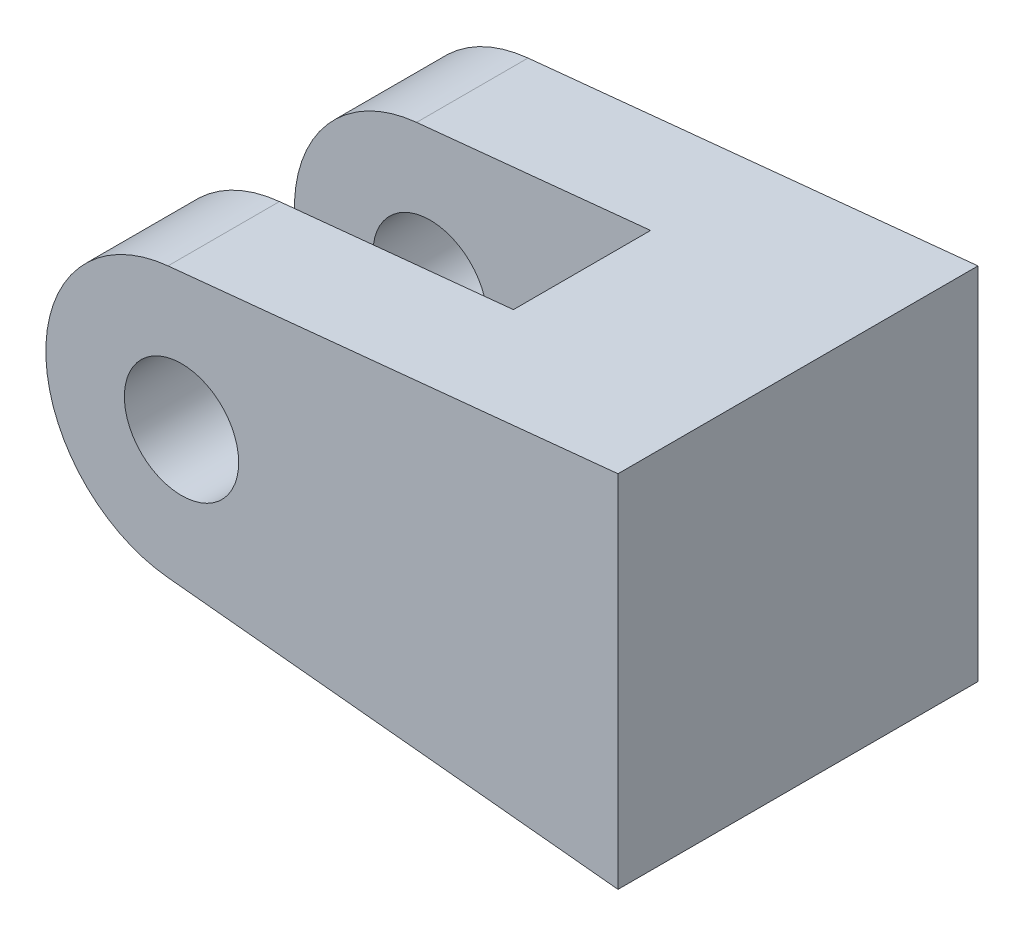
ISO-10303-21;
HEADER;
FILE_DESCRIPTION(('STEP AP214'),'2;1');
FILE_NAME('part.step','',(''),(''),'','','');
FILE_SCHEMA(('AUTOMOTIVE_DESIGN { 1 0 10303 214 1 1 1 1 }'));
ENDSEC;
DATA;
#1=APPLICATION_CONTEXT('core data for automotive mechanical design processes');
#2=APPLICATION_PROTOCOL_DEFINITION('international standard','automotive_design',2000,#1);
#3=PRODUCT_CONTEXT('',#1,'mechanical');
#4=PRODUCT('Part','Part','',(#3));
#5=PRODUCT_RELATED_PRODUCT_CATEGORY('part','',(#4));
#6=PRODUCT_DEFINITION_FORMATION('','',#4);
#7=PRODUCT_DEFINITION_CONTEXT('part definition',#1,'design');
#8=PRODUCT_DEFINITION('design','',#6,#7);
#9=PRODUCT_DEFINITION_SHAPE('','',#8);
#10=(LENGTH_UNIT() NAMED_UNIT(*) SI_UNIT(.MILLI.,.METRE.));
#11=(NAMED_UNIT(*) PLANE_ANGLE_UNIT() SI_UNIT($,.RADIAN.));
#12=(NAMED_UNIT(*) SI_UNIT($,.STERADIAN.) SOLID_ANGLE_UNIT());
#13=UNCERTAINTY_MEASURE_WITH_UNIT(LENGTH_MEASURE(1.E-05),#10,'distance_accuracy_value','');
#14=(GEOMETRIC_REPRESENTATION_CONTEXT(3) GLOBAL_UNCERTAINTY_ASSIGNED_CONTEXT((#13)) GLOBAL_UNIT_ASSIGNED_CONTEXT((#10,
#11,#12)) REPRESENTATION_CONTEXT('',''));
#15=CARTESIAN_POINT('',(0.,0.,0.));
#16=DIRECTION('',(0.,0.,1.));
#17=DIRECTION('',(1.,0.,0.));
#18=AXIS2_PLACEMENT_3D('',#15,#16,#17);
#19=CARTESIAN_POINT('',(69.980085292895,-7.78385160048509,20.));
#20=DIRECTION('',(0.,0.,-1.));
#21=DIRECTION('',(-1.,0.,0.));
#22=AXIS2_PLACEMENT_3D('',#19,#20,#21);
#23=CYLINDRICAL_SURFACE('',#22,7.53740671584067);
#24=DIRECTION('',(0.,0.,-1.));
#25=VECTOR('',#24,1.);
#26=CARTESIAN_POINT('',(69.230085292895,-0.283851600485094,20.));
#27=LINE('',#26,#25);
#28=CARTESIAN_POINT('',(69.230085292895,-0.283851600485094,20.));
#29=VERTEX_POINT('',#28);
#30=CARTESIAN_POINT('',(69.230085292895,-0.283851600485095,13.81));
#31=VERTEX_POINT('',#30);
#32=EDGE_CURVE('E40',#29,#31,#27,.T.);
#33=ORIENTED_EDGE('',*,*,#32,.T.);
#34=CARTESIAN_POINT('',(69.980085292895,-7.78385160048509,13.81));
#35=DIRECTION('',(0.,0.,1.));
#36=DIRECTION('',(1.,0.,0.));
#37=AXIS2_PLACEMENT_3D('',#34,#35,#36);
#38=CIRCLE('',#37,7.53740671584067);
#39=CARTESIAN_POINT('',(69.230085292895,-15.2838516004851,13.81));
#40=VERTEX_POINT('',#39);
#41=EDGE_CURVE('E130',#31,#40,#38,.T.);
#42=ORIENTED_EDGE('',*,*,#41,.T.);
#43=DIRECTION('',(0.,0.,-1.));
#44=VECTOR('',#43,1.);
#45=CARTESIAN_POINT('',(69.230085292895,-15.2838516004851,20.));
#46=LINE('',#45,#44);
#47=CARTESIAN_POINT('',(69.230085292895,-15.2838516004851,20.));
#48=VERTEX_POINT('',#47);
#49=EDGE_CURVE('E127',#48,#40,#46,.T.);
#50=ORIENTED_EDGE('',*,*,#49,.F.);
#51=CARTESIAN_POINT('',(69.980085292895,-7.78385160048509,20.));
#52=DIRECTION('',(0.,0.,1.));
#53=DIRECTION('',(1.,0.,0.));
#54=AXIS2_PLACEMENT_3D('',#51,#52,#53);
#55=CIRCLE('',#54,7.53740671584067);
#56=EDGE_CURVE('E85',#29,#48,#55,.T.);
#57=ORIENTED_EDGE('',*,*,#56,.F.);
#58=EDGE_LOOP('',(#33,#42,#50,#57));
#59=FACE_BOUND('',#58,.T.);
#60=ADVANCED_FACE('F32',(#59),#23,.T.);
#61=CARTESIAN_POINT('',(69.980085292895,-7.78385160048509,20.));
#62=DIRECTION('',(0.,0.,-1.));
#63=DIRECTION('',(-1.,0.,0.));
#64=AXIS2_PLACEMENT_3D('',#61,#62,#63);
#65=CYLINDRICAL_SURFACE('',#64,3.175);
#66=CARTESIAN_POINT('',(69.980085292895,-7.78385160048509,13.81));
#67=DIRECTION('',(0.,0.,1.));
#68=DIRECTION('',(1.,0.,0.));
#69=AXIS2_PLACEMENT_3D('',#66,#67,#68);
#70=CIRCLE('',#69,3.175);
#71=CARTESIAN_POINT('',(73.155085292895,-7.78385160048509,13.81));
#72=VERTEX_POINT('',#71);
#73=EDGE_CURVE('E131',#72,#72,#70,.T.);
#74=ORIENTED_EDGE('',*,*,#73,.F.);
#75=EDGE_LOOP('',(#74));
#76=FACE_BOUND('',#75,.T.);
#77=CARTESIAN_POINT('',(69.980085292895,-7.78385160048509,20.));
#78=DIRECTION('',(0.,0.,1.));
#79=DIRECTION('',(1.,0.,0.));
#80=AXIS2_PLACEMENT_3D('',#77,#78,#79);
#81=CIRCLE('',#80,3.175);
#82=CARTESIAN_POINT('',(73.155085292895,-7.78385160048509,20.));
#83=VERTEX_POINT('',#82);
#84=EDGE_CURVE('E144',#83,#83,#81,.T.);
#85=ORIENTED_EDGE('',*,*,#84,.T.);
#86=EDGE_LOOP('',(#85));
#87=FACE_BOUND('',#86,.T.);
#88=ADVANCED_FACE('F204',(#76,#87),#65,.F.);
#89=CARTESIAN_POINT('',(69.980085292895,-7.78385160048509,20.));
#90=DIRECTION('',(0.,0.,1.));
#91=DIRECTION('',(1.,0.,0.));
#92=AXIS2_PLACEMENT_3D('',#89,#90,#91);
#93=PLANE('',#92);
#94=DIRECTION('',(-0.995037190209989,-0.0995037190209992,0.));
#95=VECTOR('',#94,1.);
#96=CARTESIAN_POINT('',(94.230085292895,2.21614839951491,20.));
#97=LINE('',#96,#95);
#98=CARTESIAN_POINT('',(94.230085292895,2.21614839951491,20.));
#99=VERTEX_POINT('',#98);
#100=EDGE_CURVE('E150',#99,#29,#97,.T.);
#101=ORIENTED_EDGE('',*,*,#100,.T.);
#102=ORIENTED_EDGE('',*,*,#56,.T.);
#103=DIRECTION('',(0.995037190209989,-0.0995037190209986,0.));
#104=VECTOR('',#103,1.);
#105=CARTESIAN_POINT('',(94.230085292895,-17.7838516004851,20.));
#106=LINE('',#105,#104);
#107=CARTESIAN_POINT('',(94.230085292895,-17.7838516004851,20.));
#108=VERTEX_POINT('',#107);
#109=EDGE_CURVE('E153',#48,#108,#106,.T.);
#110=ORIENTED_EDGE('',*,*,#109,.T.);
#111=DIRECTION('',(0.,1.,0.));
#112=VECTOR('',#111,1.);
#113=CARTESIAN_POINT('',(94.230085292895,2.21614839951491,20.));
#114=LINE('',#113,#112);
#115=EDGE_CURVE('E56',#108,#99,#114,.T.);
#116=ORIENTED_EDGE('',*,*,#115,.T.);
#117=EDGE_LOOP('',(#101,#102,#110,#116));
#118=FACE_BOUND('',#117,.T.);
#119=ORIENTED_EDGE('',*,*,#84,.F.);
#120=EDGE_LOOP('',(#119));
#121=FACE_BOUND('',#120,.T.);
#122=ADVANCED_FACE('F190',(#118,#121),#93,.T.);
#123=CARTESIAN_POINT('',(69.980085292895,-7.78385160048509,0.));
#124=DIRECTION('',(0.,0.,1.));
#125=DIRECTION('',(1.,0.,0.));
#126=AXIS2_PLACEMENT_3D('',#123,#124,#125);
#127=PLANE('',#126);
#128=DIRECTION('',(-0.995037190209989,-0.0995037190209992,0.));
#129=VECTOR('',#128,1.);
#130=CARTESIAN_POINT('',(94.230085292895,2.21614839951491,0.));
#131=LINE('',#130,#129);
#132=CARTESIAN_POINT('',(94.230085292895,2.21614839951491,0.));
#133=VERTEX_POINT('',#132);
#134=CARTESIAN_POINT('',(69.230085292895,-0.283851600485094,0.));
#135=VERTEX_POINT('',#134);
#136=EDGE_CURVE('E147',#133,#135,#131,.T.);
#137=ORIENTED_EDGE('',*,*,#136,.F.);
#138=DIRECTION('',(0.,1.,0.));
#139=VECTOR('',#138,1.);
#140=CARTESIAN_POINT('',(94.230085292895,2.21614839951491,0.));
#141=LINE('',#140,#139);
#142=CARTESIAN_POINT('',(94.230085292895,-17.7838516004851,0.));
#143=VERTEX_POINT('',#142);
#144=EDGE_CURVE('E77',#143,#133,#141,.T.);
#145=ORIENTED_EDGE('',*,*,#144,.F.);
#146=DIRECTION('',(0.995037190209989,-0.0995037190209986,0.));
#147=VECTOR('',#146,1.);
#148=CARTESIAN_POINT('',(94.230085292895,-17.7838516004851,0.));
#149=LINE('',#148,#147);
#150=CARTESIAN_POINT('',(69.230085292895,-15.2838516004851,0.));
#151=VERTEX_POINT('',#150);
#152=EDGE_CURVE('E162',#151,#143,#149,.T.);
#153=ORIENTED_EDGE('',*,*,#152,.F.);
#154=CARTESIAN_POINT('',(69.980085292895,-7.78385160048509,0.));
#155=DIRECTION('',(0.,0.,1.));
#156=DIRECTION('',(1.,0.,0.));
#157=AXIS2_PLACEMENT_3D('',#154,#155,#156);
#158=CIRCLE('',#157,7.53740671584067);
#159=EDGE_CURVE('E159',#135,#151,#158,.T.);
#160=ORIENTED_EDGE('',*,*,#159,.F.);
#161=EDGE_LOOP('',(#137,#145,#153,#160));
#162=FACE_BOUND('',#161,.T.);
#163=CARTESIAN_POINT('',(69.980085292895,-7.78385160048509,0.));
#164=DIRECTION('',(0.,0.,1.));
#165=DIRECTION('',(1.,0.,0.));
#166=AXIS2_PLACEMENT_3D('',#163,#164,#165);
#167=CIRCLE('',#166,3.175);
#168=CARTESIAN_POINT('',(73.155085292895,-7.78385160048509,0.));
#169=VERTEX_POINT('',#168);
#170=EDGE_CURVE('E143',#169,#169,#167,.T.);
#171=ORIENTED_EDGE('',*,*,#170,.T.);
#172=EDGE_LOOP('',(#171));
#173=FACE_BOUND('',#172,.T.);
#174=ADVANCED_FACE('F184',(#162,#173),#127,.F.);
#175=CARTESIAN_POINT('',(94.230085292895,2.21614839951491,20.));
#176=DIRECTION('',(0.0995037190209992,-0.995037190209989,0.));
#177=DIRECTION('',(0.995037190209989,0.0995037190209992,0.));
#178=AXIS2_PLACEMENT_3D('',#175,#176,#177);
#179=PLANE('',#178);
#180=DIRECTION('',(0.,0.,1.));
#181=VECTOR('',#180,1.);
#182=CARTESIAN_POINT('',(82.230085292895,1.01614839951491,20.));
#183=LINE('',#182,#181);
#184=CARTESIAN_POINT('',(82.230085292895,1.0161483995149,6.19));
#185=VERTEX_POINT('',#184);
#186=CARTESIAN_POINT('',(82.230085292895,1.0161483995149,13.81));
#187=VERTEX_POINT('',#186);
#188=EDGE_CURVE('E119',#185,#187,#183,.T.);
#189=ORIENTED_EDGE('',*,*,#188,.T.);
#190=DIRECTION('',(-0.995037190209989,-0.0995037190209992,0.));
#191=VECTOR('',#190,1.);
#192=CARTESIAN_POINT('',(94.230085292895,2.21614839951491,13.81));
#193=LINE('',#192,#191);
#194=EDGE_CURVE('E133',#187,#31,#193,.T.);
#195=ORIENTED_EDGE('',*,*,#194,.T.);
#196=ORIENTED_EDGE('',*,*,#32,.F.);
#197=ORIENTED_EDGE('',*,*,#100,.F.);
#198=DIRECTION('',(0.,0.,-1.));
#199=VECTOR('',#198,1.);
#200=CARTESIAN_POINT('',(94.230085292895,2.21614839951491,20.));
#201=LINE('',#200,#199);
#202=EDGE_CURVE('E156',#99,#133,#201,.T.);
#203=ORIENTED_EDGE('',*,*,#202,.T.);
#204=ORIENTED_EDGE('',*,*,#136,.T.);
#205=CARTESIAN_POINT('',(69.230085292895,-0.283851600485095,6.19));
#206=VERTEX_POINT('',#205);
#207=EDGE_CURVE('E170',#206,#135,#27,.T.);
#208=ORIENTED_EDGE('',*,*,#207,.F.);
#209=DIRECTION('',(0.995037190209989,0.0995037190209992,0.));
#210=VECTOR('',#209,1.);
#211=CARTESIAN_POINT('',(94.230085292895,2.21614839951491,6.19));
#212=LINE('',#211,#210);
#213=EDGE_CURVE('E136',#206,#185,#212,.T.);
#214=ORIENTED_EDGE('',*,*,#213,.T.);
#215=EDGE_LOOP('',(#189,#195,#196,#197,#203,#204,#208,#214));
#216=FACE_BOUND('',#215,.T.);
#217=ADVANCED_FACE('F34',(#216),#179,.F.);
#218=CARTESIAN_POINT('',(69.230085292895,-15.2838516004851,6.19));
#219=VERTEX_POINT('',#218);
#220=EDGE_CURVE('E168',#219,#151,#46,.T.);
#221=ORIENTED_EDGE('',*,*,#220,.F.);
#222=CARTESIAN_POINT('',(69.980085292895,-7.78385160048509,6.19));
#223=DIRECTION('',(0.,0.,-1.));
#224=DIRECTION('',(-1.,0.,0.));
#225=AXIS2_PLACEMENT_3D('',#222,#223,#224);
#226=CIRCLE('',#225,7.53740671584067);
#227=EDGE_CURVE('E47',#219,#206,#226,.T.);
#228=ORIENTED_EDGE('',*,*,#227,.T.);
#229=ORIENTED_EDGE('',*,*,#207,.T.);
#230=ORIENTED_EDGE('',*,*,#159,.T.);
#231=EDGE_LOOP('',(#221,#228,#229,#230));
#232=FACE_BOUND('',#231,.T.);
#233=ADVANCED_FACE('F181',(#232),#23,.T.);
#234=CARTESIAN_POINT('',(94.230085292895,-17.7838516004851,20.));
#235=DIRECTION('',(0.0995037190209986,0.995037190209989,0.));
#236=DIRECTION('',(-0.995037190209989,0.0995037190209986,0.));
#237=AXIS2_PLACEMENT_3D('',#234,#235,#236);
#238=PLANE('',#237);
#239=ORIENTED_EDGE('',*,*,#49,.T.);
#240=DIRECTION('',(0.995037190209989,-0.0995037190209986,0.));
#241=VECTOR('',#240,1.);
#242=CARTESIAN_POINT('',(94.230085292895,-17.7838516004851,13.81));
#243=LINE('',#242,#241);
#244=CARTESIAN_POINT('',(82.230085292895,-16.5838516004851,13.81));
#245=VERTEX_POINT('',#244);
#246=EDGE_CURVE('E125',#40,#245,#243,.T.);
#247=ORIENTED_EDGE('',*,*,#246,.T.);
#248=DIRECTION('',(0.,0.,-1.));
#249=VECTOR('',#248,1.);
#250=CARTESIAN_POINT('',(82.230085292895,-16.5838516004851,20.));
#251=LINE('',#250,#249);
#252=CARTESIAN_POINT('',(82.230085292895,-16.5838516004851,6.19));
#253=VERTEX_POINT('',#252);
#254=EDGE_CURVE('E11',#245,#253,#251,.T.);
#255=ORIENTED_EDGE('',*,*,#254,.T.);
#256=DIRECTION('',(-0.995037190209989,0.0995037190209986,0.));
#257=VECTOR('',#256,1.);
#258=CARTESIAN_POINT('',(94.230085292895,-17.7838516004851,6.19));
#259=LINE('',#258,#257);
#260=EDGE_CURVE('E105',#253,#219,#259,.T.);
#261=ORIENTED_EDGE('',*,*,#260,.T.);
#262=ORIENTED_EDGE('',*,*,#220,.T.);
#263=ORIENTED_EDGE('',*,*,#152,.T.);
#264=DIRECTION('',(0.,0.,-1.));
#265=VECTOR('',#264,1.);
#266=CARTESIAN_POINT('',(94.230085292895,-17.7838516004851,20.));
#267=LINE('',#266,#265);
#268=EDGE_CURVE('E166',#108,#143,#267,.T.);
#269=ORIENTED_EDGE('',*,*,#268,.F.);
#270=ORIENTED_EDGE('',*,*,#109,.F.);
#271=EDGE_LOOP('',(#239,#247,#255,#261,#262,#263,#269,#270));
#272=FACE_BOUND('',#271,.T.);
#273=ADVANCED_FACE('F124',(#272),#238,.F.);
#274=CARTESIAN_POINT('',(94.230085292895,2.21614839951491,20.));
#275=DIRECTION('',(-1.,0.,0.));
#276=DIRECTION('',(0.,0.,1.));
#277=AXIS2_PLACEMENT_3D('',#274,#275,#276);
#278=PLANE('',#277);
#279=ORIENTED_EDGE('',*,*,#144,.T.);
#280=ORIENTED_EDGE('',*,*,#202,.F.);
#281=ORIENTED_EDGE('',*,*,#115,.F.);
#282=ORIENTED_EDGE('',*,*,#268,.T.);
#283=EDGE_LOOP('',(#279,#280,#281,#282));
#284=FACE_BOUND('',#283,.T.);
#285=ADVANCED_FACE('F187',(#284),#278,.F.);
#286=CARTESIAN_POINT('',(69.980085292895,-7.78385160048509,6.19));
#287=DIRECTION('',(0.,0.,-1.));
#288=DIRECTION('',(-1.,0.,0.));
#289=AXIS2_PLACEMENT_3D('',#286,#287,#288);
#290=CIRCLE('',#289,3.175);
#291=CARTESIAN_POINT('',(66.805085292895,-7.78385160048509,6.19));
#292=VERTEX_POINT('',#291);
#293=EDGE_CURVE('E112',#292,#292,#290,.T.);
#294=ORIENTED_EDGE('',*,*,#293,.F.);
#295=EDGE_LOOP('',(#294));
#296=FACE_BOUND('',#295,.T.);
#297=ORIENTED_EDGE('',*,*,#170,.F.);
#298=EDGE_LOOP('',(#297));
#299=FACE_BOUND('',#298,.T.);
#300=ADVANCED_FACE('F201',(#296,#299),#65,.F.);
#301=CARTESIAN_POINT('',(82.230085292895,-17.7838516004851,6.19));
#302=DIRECTION('',(1.,0.,0.));
#303=DIRECTION('',(0.,0.,-1.));
#304=AXIS2_PLACEMENT_3D('',#301,#302,#303);
#305=PLANE('',#304);
#306=DIRECTION('',(0.,1.,0.));
#307=VECTOR('',#306,1.);
#308=CARTESIAN_POINT('',(82.230085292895,-17.7838516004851,6.19));
#309=LINE('',#308,#307);
#310=EDGE_CURVE('E108',#253,#185,#309,.T.);
#311=ORIENTED_EDGE('',*,*,#310,.F.);
#312=ORIENTED_EDGE('',*,*,#254,.F.);
#313=DIRECTION('',(0.,1.,0.));
#314=VECTOR('',#313,1.);
#315=CARTESIAN_POINT('',(82.230085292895,-17.7838516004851,13.81));
#316=LINE('',#315,#314);
#317=EDGE_CURVE('E120',#245,#187,#316,.T.);
#318=ORIENTED_EDGE('',*,*,#317,.T.);
#319=ORIENTED_EDGE('',*,*,#188,.F.);
#320=EDGE_LOOP('',(#311,#312,#318,#319));
#321=FACE_BOUND('',#320,.T.);
#322=ADVANCED_FACE('F115',(#321),#305,.F.);
#323=CARTESIAN_POINT('',(82.230085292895,-17.7838516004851,13.81));
#324=DIRECTION('',(0.,0.,1.));
#325=DIRECTION('',(1.,0.,0.));
#326=AXIS2_PLACEMENT_3D('',#323,#324,#325);
#327=PLANE('',#326);
#328=ORIENTED_EDGE('',*,*,#73,.T.);
#329=EDGE_LOOP('',(#328));
#330=FACE_BOUND('',#329,.T.);
#331=ORIENTED_EDGE('',*,*,#317,.F.);
#332=ORIENTED_EDGE('',*,*,#246,.F.);
#333=ORIENTED_EDGE('',*,*,#41,.F.);
#334=ORIENTED_EDGE('',*,*,#194,.F.);
#335=EDGE_LOOP('',(#331,#332,#333,#334));
#336=FACE_BOUND('',#335,.T.);
#337=ADVANCED_FACE('F192',(#330,#336),#327,.F.);
#338=CARTESIAN_POINT('',(82.230085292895,-17.7838516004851,6.19));
#339=DIRECTION('',(0.,0.,-1.));
#340=DIRECTION('',(-1.,0.,0.));
#341=AXIS2_PLACEMENT_3D('',#338,#339,#340);
#342=PLANE('',#341);
#343=ORIENTED_EDGE('',*,*,#293,.T.);
#344=EDGE_LOOP('',(#343));
#345=FACE_BOUND('',#344,.T.);
#346=ORIENTED_EDGE('',*,*,#227,.F.);
#347=ORIENTED_EDGE('',*,*,#260,.F.);
#348=ORIENTED_EDGE('',*,*,#310,.T.);
#349=ORIENTED_EDGE('',*,*,#213,.F.);
#350=EDGE_LOOP('',(#346,#347,#348,#349));
#351=FACE_BOUND('',#350,.T.);
#352=ADVANCED_FACE('F107',(#345,#351),#342,.F.);
#353=CLOSED_SHELL('',(#60,#88,#122,#174,#217,#233,#273,#285,#300,#322,#337,#352));
#354=MANIFOLD_SOLID_BREP('B2',#353);
#355=ADVANCED_BREP_SHAPE_REPRESENTATION('',(#18,#354),#14);
#356=SHAPE_DEFINITION_REPRESENTATION(#9,#355);
ENDSEC;
END-ISO-10303-21;
